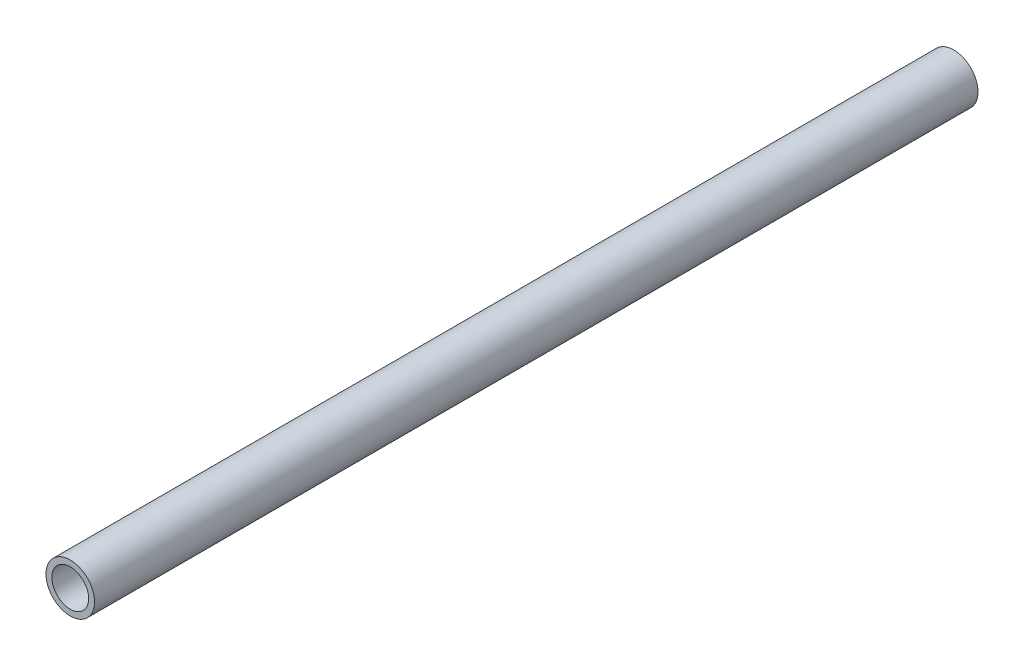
ISO-10303-21;
HEADER;
FILE_DESCRIPTION(('STEP AP214'),'2;1');
FILE_NAME('part.step','',(''),(''),'','','');
FILE_SCHEMA(('AUTOMOTIVE_DESIGN { 1 0 10303 214 1 1 1 1 }'));
ENDSEC;
DATA;
#1=APPLICATION_CONTEXT('core data for automotive mechanical design processes');
#2=APPLICATION_PROTOCOL_DEFINITION('international standard','automotive_design',2000,#1);
#3=PRODUCT_CONTEXT('',#1,'mechanical');
#4=PRODUCT('Part','Part','',(#3));
#5=PRODUCT_RELATED_PRODUCT_CATEGORY('part','',(#4));
#6=PRODUCT_DEFINITION_FORMATION('','',#4);
#7=PRODUCT_DEFINITION_CONTEXT('part definition',#1,'design');
#8=PRODUCT_DEFINITION('design','',#6,#7);
#9=PRODUCT_DEFINITION_SHAPE('','',#8);
#10=(LENGTH_UNIT() NAMED_UNIT(*) SI_UNIT(.MILLI.,.METRE.));
#11=(NAMED_UNIT(*) PLANE_ANGLE_UNIT() SI_UNIT($,.RADIAN.));
#12=(NAMED_UNIT(*) SI_UNIT($,.STERADIAN.) SOLID_ANGLE_UNIT());
#13=UNCERTAINTY_MEASURE_WITH_UNIT(LENGTH_MEASURE(1.E-05),#10,'distance_accuracy_value','');
#14=(GEOMETRIC_REPRESENTATION_CONTEXT(3) GLOBAL_UNCERTAINTY_ASSIGNED_CONTEXT((#13)) GLOBAL_UNIT_ASSIGNED_CONTEXT((#10,
#11,#12)) REPRESENTATION_CONTEXT('',''));
#15=CARTESIAN_POINT('',(0.,0.,0.));
#16=DIRECTION('',(0.,0.,1.));
#17=DIRECTION('',(1.,0.,0.));
#18=AXIS2_PLACEMENT_3D('',#15,#16,#17);
#19=CARTESIAN_POINT('',(0.,0.,300.));
#20=DIRECTION('',(0.,0.,1.));
#21=DIRECTION('',(1.,0.,0.));
#22=AXIS2_PLACEMENT_3D('',#19,#20,#21);
#23=PLANE('',#22);
#24=CARTESIAN_POINT('',(0.,0.,300.));
#25=DIRECTION('',(0.,0.,1.));
#26=DIRECTION('',(1.,0.,0.));
#27=AXIS2_PLACEMENT_3D('',#24,#25,#26);
#28=CIRCLE('',#27,8.25);
#29=CARTESIAN_POINT('',(8.25,0.,300.));
#30=VERTEX_POINT('',#29);
#31=EDGE_CURVE('E10',#30,#30,#28,.T.);
#32=ORIENTED_EDGE('',*,*,#31,.T.);
#33=EDGE_LOOP('',(#32));
#34=FACE_BOUND('',#33,.T.);
#35=CARTESIAN_POINT('',(0.,0.,300.));
#36=DIRECTION('',(0.,0.,1.));
#37=DIRECTION('',(1.,0.,0.));
#38=AXIS2_PLACEMENT_3D('',#35,#36,#37);
#39=CIRCLE('',#38,6.25);
#40=CARTESIAN_POINT('',(6.25,0.,300.));
#41=VERTEX_POINT('',#40);
#42=EDGE_CURVE('E45',#41,#41,#39,.T.);
#43=ORIENTED_EDGE('',*,*,#42,.F.);
#44=EDGE_LOOP('',(#43));
#45=FACE_BOUND('',#44,.T.);
#46=ADVANCED_FACE('F34',(#34,#45),#23,.T.);
#47=CARTESIAN_POINT('',(0.,0.,0.));
#48=DIRECTION('',(0.,0.,1.));
#49=DIRECTION('',(1.,0.,0.));
#50=AXIS2_PLACEMENT_3D('',#47,#48,#49);
#51=PLANE('',#50);
#52=CARTESIAN_POINT('',(0.,0.,0.));
#53=DIRECTION('',(0.,0.,1.));
#54=DIRECTION('',(1.,0.,0.));
#55=AXIS2_PLACEMENT_3D('',#52,#53,#54);
#56=CIRCLE('',#55,8.25);
#57=CARTESIAN_POINT('',(8.25,0.,0.));
#58=VERTEX_POINT('',#57);
#59=EDGE_CURVE('E38',#58,#58,#56,.T.);
#60=ORIENTED_EDGE('',*,*,#59,.F.);
#61=EDGE_LOOP('',(#60));
#62=FACE_BOUND('',#61,.T.);
#63=CARTESIAN_POINT('',(0.,0.,0.));
#64=DIRECTION('',(0.,0.,1.));
#65=DIRECTION('',(1.,0.,0.));
#66=AXIS2_PLACEMENT_3D('',#63,#64,#65);
#67=CIRCLE('',#66,6.25);
#68=CARTESIAN_POINT('',(6.25,0.,0.));
#69=VERTEX_POINT('',#68);
#70=EDGE_CURVE('E47',#69,#69,#67,.T.);
#71=ORIENTED_EDGE('',*,*,#70,.T.);
#72=EDGE_LOOP('',(#71));
#73=FACE_BOUND('',#72,.T.);
#74=ADVANCED_FACE('F57',(#62,#73),#51,.F.);
#75=CARTESIAN_POINT('',(0.,0.,300.));
#76=DIRECTION('',(0.,0.,-1.));
#77=DIRECTION('',(-1.,0.,0.));
#78=AXIS2_PLACEMENT_3D('',#75,#76,#77);
#79=CYLINDRICAL_SURFACE('',#78,8.25);
#80=ORIENTED_EDGE('',*,*,#31,.F.);
#81=EDGE_LOOP('',(#80));
#82=FACE_BOUND('',#81,.T.);
#83=ORIENTED_EDGE('',*,*,#59,.T.);
#84=EDGE_LOOP('',(#83));
#85=FACE_BOUND('',#84,.T.);
#86=ADVANCED_FACE('F36',(#82,#85),#79,.T.);
#87=CARTESIAN_POINT('',(0.,0.,300.));
#88=DIRECTION('',(0.,0.,-1.));
#89=DIRECTION('',(-1.,0.,0.));
#90=AXIS2_PLACEMENT_3D('',#87,#88,#89);
#91=CYLINDRICAL_SURFACE('',#90,6.25);
#92=ORIENTED_EDGE('',*,*,#42,.T.);
#93=EDGE_LOOP('',(#92));
#94=FACE_BOUND('',#93,.T.);
#95=ORIENTED_EDGE('',*,*,#70,.F.);
#96=EDGE_LOOP('',(#95));
#97=FACE_BOUND('',#96,.T.);
#98=ADVANCED_FACE('F53',(#94,#97),#91,.F.);
#99=CLOSED_SHELL('',(#46,#74,#86,#98));
#100=MANIFOLD_SOLID_BREP('B2',#99);
#101=ADVANCED_BREP_SHAPE_REPRESENTATION('',(#18,#100),#14);
#102=SHAPE_DEFINITION_REPRESENTATION(#9,#101);
ENDSEC;
END-ISO-10303-21;
